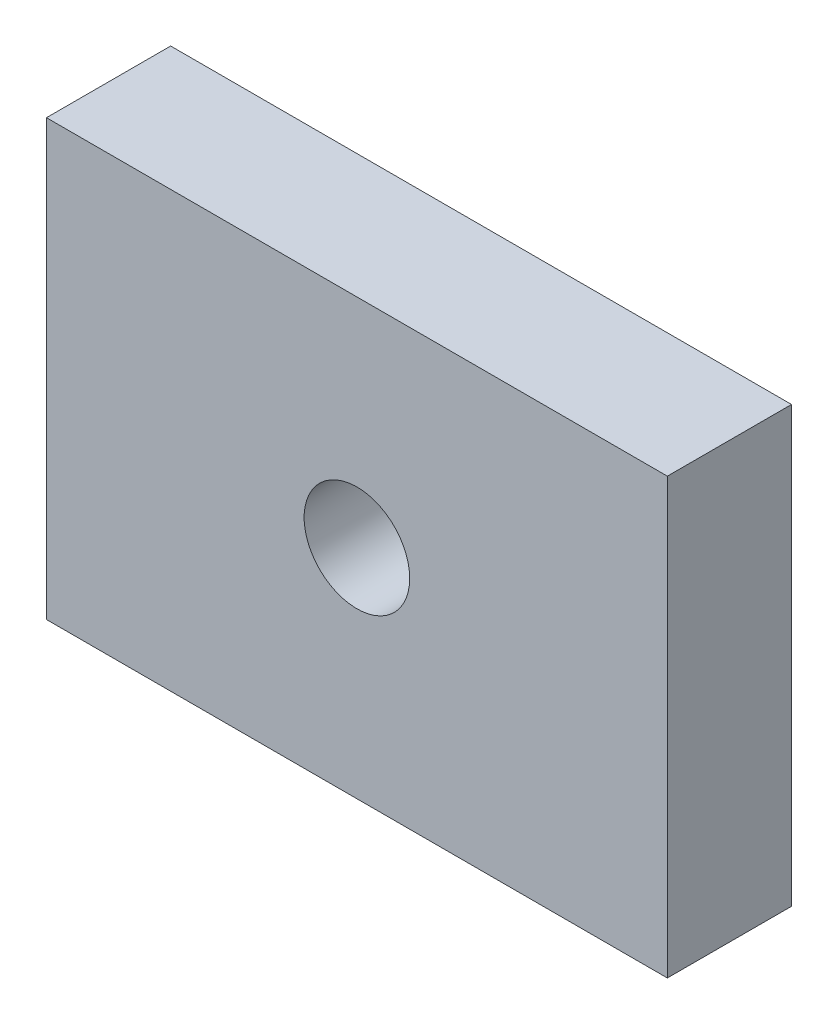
from build123d import *

# Parameters (mm, degrees)
SKIZZE1_W                 = 50
SKIZZE1_H                 = 35
LINEAR_AUSTRAGEN1_DEPTH   = 10
M10_GEWINDEBOHRUNG1_D     = 8.5
M10_GEWINDEBOHRUNG1_DEPTH = 27.5
M10_GEWINDEBOHRUNG1_TIP   = 2.553657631


with BuildPart() as part:
    # Skizze1 → Linear austragen1 (new body)
    with BuildSketch(Plane.XY):
        with Locations((25, 17.5)):
            Rectangle(SKIZZE1_W, SKIZZE1_H)
    extrude(amount=LINEAR_AUSTRAGEN1_DEPTH)

    # M10 Gewindebohrung1
    with Locations(Plane.XY.offset(10)):
        with Locations((25, 17.5)):
            Hole(M10_GEWINDEBOHRUNG1_D / 2, depth=M10_GEWINDEBOHRUNG1_DEPTH)
            with Locations((0, 0, -(M10_GEWINDEBOHRUNG1_DEPTH + M10_GEWINDEBOHRUNG1_TIP / 2))):  # 118° drill point
                Cone(0, M10_GEWINDEBOHRUNG1_D / 2, M10_GEWINDEBOHRUNG1_TIP, mode=Mode.SUBTRACT)


solid = part.part
